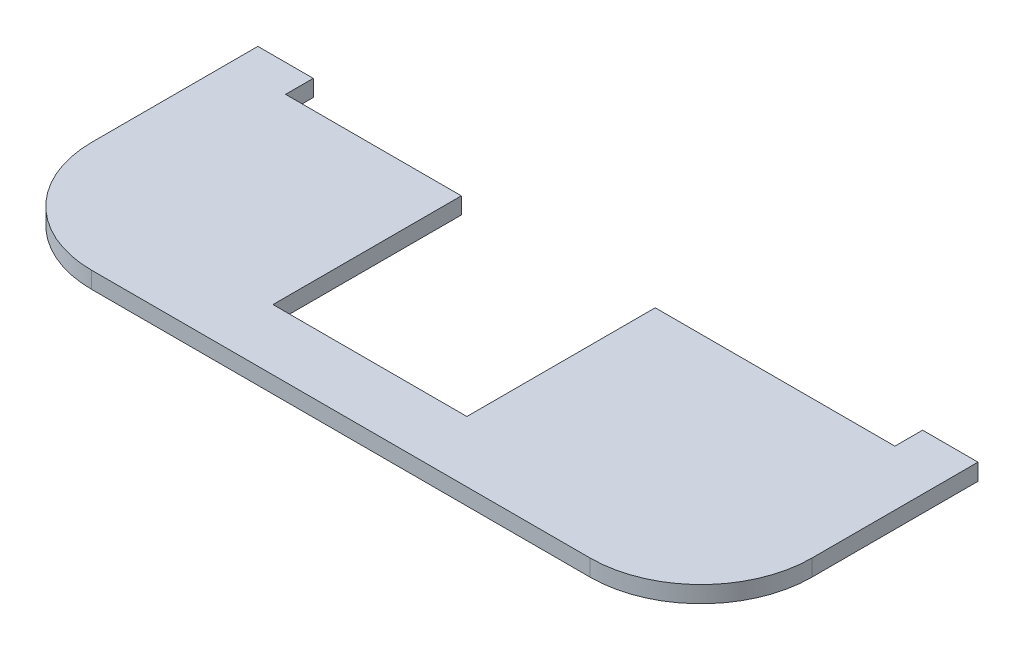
from build123d import *

# Parameters (mm, degrees)
BOSS_EXTRUDE1_DEPTH     = 3
CUT_EXTRUDE1_DEPTH      = 148.678705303
CUT_EXTRUDE1_DEPTH_BACK = 148.678705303
SKETCH4_W               = 130
SKETCH4_H               = 15
CUT_EXTRUDE2_DEPTH      = 10
CUT_EXTRUDE3_DEPTH      = 10


with BuildPart() as part:
    # Sketch1 → Boss-Extrude1 (new body)
    with BuildSketch(Plane(origin=(0, 0, 0), x_dir=(1, 0, 0), z_dir=(0, 1, 0))):
        with BuildLine():
            Line((20, 0), (110, 0))
            ThreePointArc((110, 0), (124.142135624, 5.857864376), (130, 20))
            Line((130, 20), (130, 70))
            Line((130, 70), (0, 70))
            Line((0, 70), (0, 20))
            ThreePointArc((0, 20), (5.857864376, 5.857864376), (20, 0))
        make_face()
    extrude(amount=BOSS_EXTRUDE1_DEPTH)

    # Sketch2 → Cut-Extrude1 (cut, two sides: drawn at the far end of the back side and taken through both)
    with BuildSketch(Plane(origin=(0, 3, 0), x_dir=(1, 0, 0), z_dir=(0, 1, 0)).offset(-CUT_EXTRUDE1_DEPTH_BACK)):
        Polygon((10, 70), (120, 70), (120, 50), (76.731661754, 50), (76.731661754, 16), (41.731661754, 16), (41.731661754, 50), (10, 50), (10, 53), align=None)
    extrude(amount=CUT_EXTRUDE1_DEPTH + CUT_EXTRUDE1_DEPTH_BACK, mode=Mode.SUBTRACT)

    # Sketch4 → Cut-Extrude2 (cut)
    with BuildSketch(Plane(origin=(0, 3, 0), x_dir=(1, 0, 0), z_dir=(0, 1, 0))):
        with Locations((65, 62.5)):
            Rectangle(SKETCH4_W, SKETCH4_H)
    extrude(amount=-CUT_EXTRUDE2_DEPTH, mode=Mode.SUBTRACT)

    # Sketch5 → Cut-Extrude3 (cut)
    with BuildSketch(Plane(origin=(0, 3, 0), x_dir=(1, 0, 0), z_dir=(0, 1, 0))):
        with BuildLine():
            Line((20, 5), (110, 5))
            ThreePointArc((110, 5), (124.142135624, 10.857864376), (130, 25))
            Line((130, 25), (130, -8.865454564))
            Line((130, -8.865454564), (0, -8.865454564))
            Line((0, -8.865454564), (0, 25))
            ThreePointArc((0, 25), (5.857864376, 10.857864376), (20, 5))
        make_face()
    extrude(amount=-CUT_EXTRUDE3_DEPTH, mode=Mode.SUBTRACT)


solid = part.part
